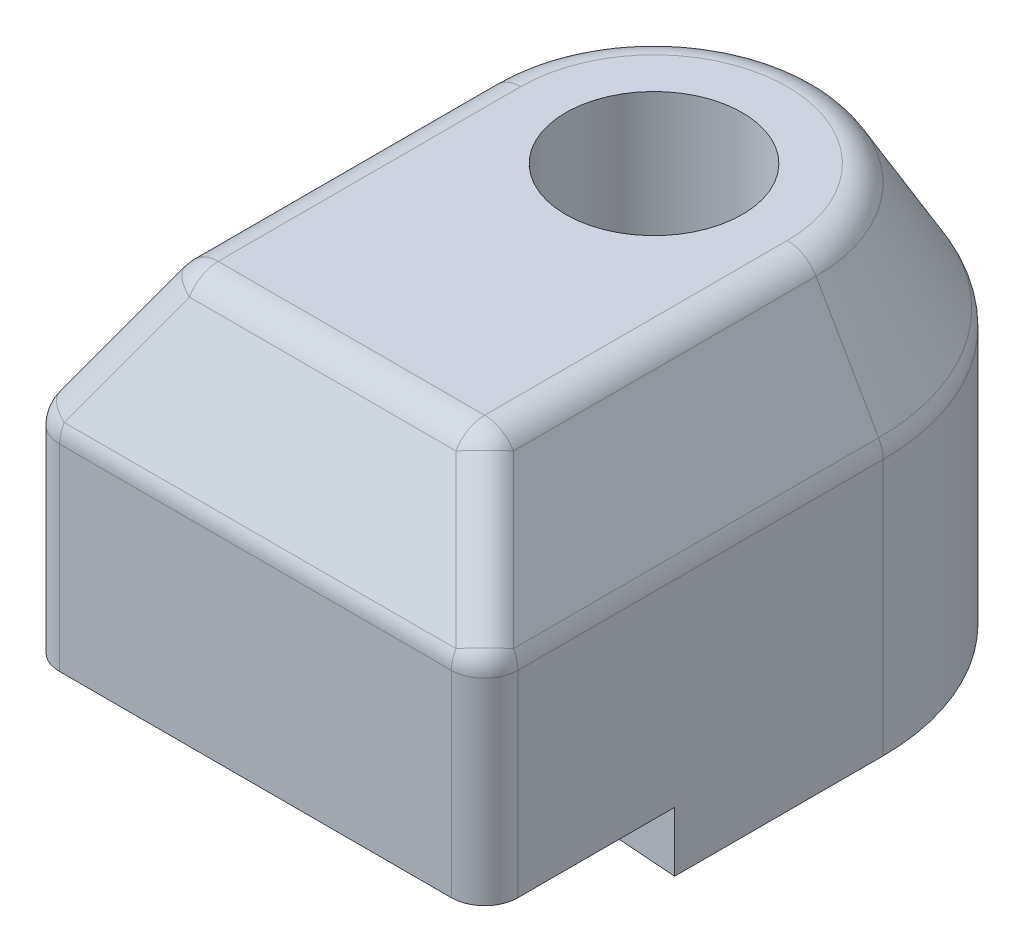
ISO-10303-21;
HEADER;
FILE_DESCRIPTION(('STEP AP214'),'2;1');
FILE_NAME('part.step','',(''),(''),'','','');
FILE_SCHEMA(('AUTOMOTIVE_DESIGN { 1 0 10303 214 1 1 1 1 }'));
ENDSEC;
DATA;
#1=APPLICATION_CONTEXT('core data for automotive mechanical design processes');
#2=APPLICATION_PROTOCOL_DEFINITION('international standard','automotive_design',2000,#1);
#3=PRODUCT_CONTEXT('',#1,'mechanical');
#4=PRODUCT('Part','Part','',(#3));
#5=PRODUCT_RELATED_PRODUCT_CATEGORY('part','',(#4));
#6=PRODUCT_DEFINITION_FORMATION('','',#4);
#7=PRODUCT_DEFINITION_CONTEXT('part definition',#1,'design');
#8=PRODUCT_DEFINITION('design','',#6,#7);
#9=PRODUCT_DEFINITION_SHAPE('','',#8);
#10=(LENGTH_UNIT() NAMED_UNIT(*) SI_UNIT(.MILLI.,.METRE.));
#11=(NAMED_UNIT(*) PLANE_ANGLE_UNIT() SI_UNIT($,.RADIAN.));
#12=(NAMED_UNIT(*) SI_UNIT($,.STERADIAN.) SOLID_ANGLE_UNIT());
#13=UNCERTAINTY_MEASURE_WITH_UNIT(LENGTH_MEASURE(1.E-05),#10,'distance_accuracy_value','');
#14=(GEOMETRIC_REPRESENTATION_CONTEXT(3) GLOBAL_UNCERTAINTY_ASSIGNED_CONTEXT((#13)) GLOBAL_UNIT_ASSIGNED_CONTEXT((#10,
#11,#12)) REPRESENTATION_CONTEXT('',''));
#15=CARTESIAN_POINT('',(0.,0.,0.));
#16=DIRECTION('',(0.,0.,1.));
#17=DIRECTION('',(1.,0.,0.));
#18=AXIS2_PLACEMENT_3D('',#15,#16,#17);
#19=CARTESIAN_POINT('',(-8.76299999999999,15.24,15.24));
#20=DIRECTION('',(0.,0.,-1.));
#21=DIRECTION('',(-1.,0.,0.));
#22=AXIS2_PLACEMENT_3D('',#19,#20,#21);
#23=PLANE('',#22);
#24=DIRECTION('',(-1.,0.,0.));
#25=VECTOR('',#24,1.);
#26=CARTESIAN_POINT('',(-8.76299999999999,2.286,15.24));
#27=LINE('',#26,#25);
#28=CARTESIAN_POINT('',(7.49299999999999,2.286,15.24));
#29=VERTEX_POINT('',#28);
#30=CARTESIAN_POINT('',(-7.49299999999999,2.286,15.24));
#31=VERTEX_POINT('',#30);
#32=EDGE_CURVE('E216',#29,#31,#27,.T.);
#33=ORIENTED_EDGE('',*,*,#32,.F.);
#34=DIRECTION('',(0.,-1.,0.));
#35=VECTOR('',#34,1.);
#36=CARTESIAN_POINT('',(7.49299999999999,15.24,15.24));
#37=LINE('',#36,#35);
#38=CARTESIAN_POINT('',(7.49299999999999,9.81970452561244,15.24));
#39=VERTEX_POINT('',#38);
#40=EDGE_CURVE('E63',#29,#39,#37,.F.);
#41=ORIENTED_EDGE('',*,*,#40,.T.);
#42=DIRECTION('',(-1.,0.,0.));
#43=VECTOR('',#42,1.);
#44=CARTESIAN_POINT('',(-8.76299999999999,9.81970452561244,15.24));
#45=LINE('',#44,#43);
#46=CARTESIAN_POINT('',(-7.49299999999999,9.81970452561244,15.24));
#47=VERTEX_POINT('',#46);
#48=EDGE_CURVE('E70',#39,#47,#45,.T.);
#49=ORIENTED_EDGE('',*,*,#48,.T.);
#50=DIRECTION('',(0.,-1.,0.));
#51=VECTOR('',#50,1.);
#52=CARTESIAN_POINT('',(-7.49299999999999,15.24,15.24));
#53=LINE('',#52,#51);
#54=EDGE_CURVE('E323',#47,#31,#53,.T.);
#55=ORIENTED_EDGE('',*,*,#54,.T.);
#56=EDGE_LOOP('',(#33,#41,#49,#55));
#57=FACE_BOUND('',#56,.T.);
#58=ADVANCED_FACE('F42',(#57),#23,.F.);
#59=CARTESIAN_POINT('',(0.,15.24,0.));
#60=DIRECTION('',(0.,-1.,0.));
#61=DIRECTION('',(0.,0.,-1.));
#62=AXIS2_PLACEMENT_3D('',#59,#60,#61);
#63=CYLINDRICAL_SURFACE('',#62,8.76299999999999);
#64=DIRECTION('',(0.,-1.,0.));
#65=VECTOR('',#64,1.);
#66=CARTESIAN_POINT('',(-8.76299999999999,15.24,0.));
#67=LINE('',#66,#65);
#68=CARTESIAN_POINT('',(-8.76299999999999,9.81970452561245,0.));
#69=VERTEX_POINT('',#68);
#70=CARTESIAN_POINT('',(-8.76299999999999,0.,0.));
#71=VERTEX_POINT('',#70);
#72=EDGE_CURVE('E247',#69,#71,#67,.T.);
#73=ORIENTED_EDGE('',*,*,#72,.F.);
#74=CARTESIAN_POINT('',(0.,9.81970452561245,0.));
#75=DIRECTION('',(0.,1.,0.));
#76=DIRECTION('',(0.,0.,1.));
#77=AXIS2_PLACEMENT_3D('',#74,#75,#76);
#78=CIRCLE('',#77,8.76299999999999);
#79=CARTESIAN_POINT('',(8.76299999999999,9.81970452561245,0.));
#80=VERTEX_POINT('',#79);
#81=EDGE_CURVE('E300',#69,#80,#78,.F.);
#82=ORIENTED_EDGE('',*,*,#81,.T.);
#83=DIRECTION('',(0.,-1.,0.));
#84=VECTOR('',#83,1.);
#85=CARTESIAN_POINT('',(8.76299999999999,15.24,0.));
#86=LINE('',#85,#84);
#87=CARTESIAN_POINT('',(8.76299999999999,0.,0.));
#88=VERTEX_POINT('',#87);
#89=EDGE_CURVE('E244',#80,#88,#86,.T.);
#90=ORIENTED_EDGE('',*,*,#89,.T.);
#91=CARTESIAN_POINT('',(0.,0.,0.));
#92=DIRECTION('',(0.,1.,0.));
#93=DIRECTION('',(0.,0.,1.));
#94=AXIS2_PLACEMENT_3D('',#91,#92,#93);
#95=CIRCLE('',#94,8.76299999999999);
#96=EDGE_CURVE('E234',#88,#71,#95,.T.);
#97=ORIENTED_EDGE('',*,*,#96,.T.);
#98=EDGE_LOOP('',(#73,#82,#90,#97));
#99=FACE_BOUND('',#98,.T.);
#100=ADVANCED_FACE('F469',(#99),#63,.T.);
#101=CARTESIAN_POINT('',(-8.76299999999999,15.24,0.));
#102=DIRECTION('',(1.,0.,0.));
#103=DIRECTION('',(0.,0.,-1.));
#104=AXIS2_PLACEMENT_3D('',#101,#102,#103);
#105=PLANE('',#104);
#106=DIRECTION('',(0.,-1.,0.));
#107=VECTOR('',#106,1.);
#108=CARTESIAN_POINT('',(-8.76299999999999,15.24,13.97));
#109=LINE('',#108,#107);
#110=CARTESIAN_POINT('',(-8.76299999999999,2.286,13.97));
#111=VERTEX_POINT('',#110);
#112=CARTESIAN_POINT('',(-8.76299999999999,9.81970452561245,13.97));
#113=VERTEX_POINT('',#112);
#114=EDGE_CURVE('E309',#111,#113,#109,.F.);
#115=ORIENTED_EDGE('',*,*,#114,.T.);
#116=DIRECTION('',(0.,0.,-1.));
#117=VECTOR('',#116,1.);
#118=CARTESIAN_POINT('',(-8.76299999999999,9.81970452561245,0.));
#119=LINE('',#118,#117);
#120=EDGE_CURVE('E312',#113,#69,#119,.T.);
#121=ORIENTED_EDGE('',*,*,#120,.T.);
#122=ORIENTED_EDGE('',*,*,#72,.T.);
#123=DIRECTION('',(0.,0.,1.));
#124=VECTOR('',#123,1.);
#125=CARTESIAN_POINT('',(-8.76299999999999,0.,0.));
#126=LINE('',#125,#124);
#127=CARTESIAN_POINT('',(-8.76299999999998,0.,7.97067474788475));
#128=VERTEX_POINT('',#127);
#129=EDGE_CURVE('E214',#71,#128,#126,.T.);
#130=ORIENTED_EDGE('',*,*,#129,.T.);
#131=DIRECTION('',(0.,-1.,0.));
#132=VECTOR('',#131,1.);
#133=CARTESIAN_POINT('',(-8.763,2.286,7.97067474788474));
#134=LINE('',#133,#132);
#135=CARTESIAN_POINT('',(-8.763,2.286,7.97067474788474));
#136=VERTEX_POINT('',#135);
#137=EDGE_CURVE('E204',#136,#128,#134,.T.);
#138=ORIENTED_EDGE('',*,*,#137,.F.);
#139=DIRECTION('',(0.,0.,-1.));
#140=VECTOR('',#139,1.);
#141=CARTESIAN_POINT('',(-8.76299999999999,2.286,15.24));
#142=LINE('',#141,#140);
#143=EDGE_CURVE('E188',#111,#136,#142,.T.);
#144=ORIENTED_EDGE('',*,*,#143,.F.);
#145=EDGE_LOOP('',(#115,#121,#122,#130,#138,#144));
#146=FACE_BOUND('',#145,.T.);
#147=ADVANCED_FACE('F212',(#146),#105,.F.);
#148=CARTESIAN_POINT('',(8.76299999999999,15.24,15.24));
#149=DIRECTION('',(-1.,0.,0.));
#150=DIRECTION('',(0.,0.,1.));
#151=AXIS2_PLACEMENT_3D('',#148,#149,#150);
#152=PLANE('',#151);
#153=ORIENTED_EDGE('',*,*,#89,.F.);
#154=DIRECTION('',(0.,0.,1.));
#155=VECTOR('',#154,1.);
#156=CARTESIAN_POINT('',(8.76299999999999,9.81970452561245,15.24));
#157=LINE('',#156,#155);
#158=CARTESIAN_POINT('',(8.76299999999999,9.81970452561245,13.97));
#159=VERTEX_POINT('',#158);
#160=EDGE_CURVE('E284',#80,#159,#157,.T.);
#161=ORIENTED_EDGE('',*,*,#160,.T.);
#162=DIRECTION('',(0.,-1.,0.));
#163=VECTOR('',#162,1.);
#164=CARTESIAN_POINT('',(8.76299999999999,15.24,13.97));
#165=LINE('',#164,#163);
#166=CARTESIAN_POINT('',(8.76299999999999,2.286,13.97));
#167=VERTEX_POINT('',#166);
#168=EDGE_CURVE('E281',#159,#167,#165,.T.);
#169=ORIENTED_EDGE('',*,*,#168,.T.);
#170=DIRECTION('',(0.,0.,1.));
#171=VECTOR('',#170,1.);
#172=CARTESIAN_POINT('',(8.76299999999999,2.286,15.24));
#173=LINE('',#172,#171);
#174=CARTESIAN_POINT('',(8.76299999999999,2.286,7.97067474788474));
#175=VERTEX_POINT('',#174);
#176=EDGE_CURVE('E209',#175,#167,#173,.T.);
#177=ORIENTED_EDGE('',*,*,#176,.F.);
#178=DIRECTION('',(0.,-1.,0.));
#179=VECTOR('',#178,1.);
#180=CARTESIAN_POINT('',(8.76299999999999,2.286,7.97067474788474));
#181=LINE('',#180,#179);
#182=CARTESIAN_POINT('',(8.76299999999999,0.,7.97067474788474));
#183=VERTEX_POINT('',#182);
#184=EDGE_CURVE('E207',#175,#183,#181,.T.);
#185=ORIENTED_EDGE('',*,*,#184,.T.);
#186=DIRECTION('',(0.,0.,-1.));
#187=VECTOR('',#186,1.);
#188=CARTESIAN_POINT('',(8.76299999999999,0.,15.24));
#189=LINE('',#188,#187);
#190=EDGE_CURVE('E240',#183,#88,#189,.T.);
#191=ORIENTED_EDGE('',*,*,#190,.T.);
#192=EDGE_LOOP('',(#153,#161,#169,#177,#185,#191));
#193=FACE_BOUND('',#192,.T.);
#194=ADVANCED_FACE('F464',(#193),#152,.F.);
#195=CARTESIAN_POINT('',(0.,15.24,0.));
#196=DIRECTION('',(0.,1.,0.));
#197=DIRECTION('',(0.,0.,1.));
#198=AXIS2_PLACEMENT_3D('',#195,#196,#197);
#199=PLANE('',#198);
#200=DIRECTION('',(1.,0.,0.));
#201=VECTOR('',#200,1.);
#202=CARTESIAN_POINT('',(0.,15.24,11.5738257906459));
#203=LINE('',#202,#201);
#204=CARTESIAN_POINT('',(-5.09682579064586,15.24,11.5738257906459));
#205=VERTEX_POINT('',#204);
#206=CARTESIAN_POINT('',(5.09682579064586,15.24,11.5738257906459));
#207=VERTEX_POINT('',#206);
#208=EDGE_CURVE('E250',#205,#207,#203,.T.);
#209=ORIENTED_EDGE('',*,*,#208,.T.);
#210=DIRECTION('',(0.,0.,-1.));
#211=VECTOR('',#210,1.);
#212=CARTESIAN_POINT('',(5.09682579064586,15.24,0.));
#213=LINE('',#212,#211);
#214=CARTESIAN_POINT('',(5.09682579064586,15.24,0.));
#215=VERTEX_POINT('',#214);
#216=EDGE_CURVE('E267',#207,#215,#213,.T.);
#217=ORIENTED_EDGE('',*,*,#216,.T.);
#218=CARTESIAN_POINT('',(0.,15.24,0.));
#219=DIRECTION('',(0.,1.,0.));
#220=DIRECTION('',(0.,0.,1.));
#221=AXIS2_PLACEMENT_3D('',#218,#219,#220);
#222=CIRCLE('',#221,5.09682579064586);
#223=CARTESIAN_POINT('',(-5.09682579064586,15.24,0.));
#224=VERTEX_POINT('',#223);
#225=EDGE_CURVE('E264',#215,#224,#222,.T.);
#226=ORIENTED_EDGE('',*,*,#225,.T.);
#227=DIRECTION('',(0.,0.,1.));
#228=VECTOR('',#227,1.);
#229=CARTESIAN_POINT('',(-5.09682579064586,15.24,0.));
#230=LINE('',#229,#228);
#231=EDGE_CURVE('E261',#224,#205,#230,.T.);
#232=ORIENTED_EDGE('',*,*,#231,.T.);
#233=EDGE_LOOP('',(#209,#217,#226,#232));
#234=FACE_BOUND('',#233,.T.);
#235=CARTESIAN_POINT('',(0.,15.24,0.));
#236=DIRECTION('',(0.,1.,0.));
#237=DIRECTION('',(0.,0.,1.));
#238=AXIS2_PLACEMENT_3D('',#235,#236,#237);
#239=CIRCLE('',#238,3.37819999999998);
#240=CARTESIAN_POINT('',(0.,15.24,3.37819999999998));
#241=VERTEX_POINT('',#240);
#242=EDGE_CURVE('E221',#241,#241,#239,.T.);
#243=ORIENTED_EDGE('',*,*,#242,.F.);
#244=EDGE_LOOP('',(#243));
#245=FACE_BOUND('',#244,.T.);
#246=ADVANCED_FACE('F488',(#234,#245),#199,.T.);
#247=CARTESIAN_POINT('',(0.,0.,0.));
#248=DIRECTION('',(0.,1.,0.));
#249=DIRECTION('',(0.,0.,1.));
#250=AXIS2_PLACEMENT_3D('',#247,#248,#249);
#251=PLANE('',#250);
#252=CARTESIAN_POINT('',(0.,0.,0.));
#253=DIRECTION('',(0.,1.,0.));
#254=DIRECTION('',(0.,0.,1.));
#255=AXIS2_PLACEMENT_3D('',#252,#253,#254);
#256=CIRCLE('',#255,3.37819999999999);
#257=CARTESIAN_POINT('',(0.,0.,3.37819999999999));
#258=VERTEX_POINT('',#257);
#259=EDGE_CURVE('E230',#258,#258,#256,.T.);
#260=ORIENTED_EDGE('',*,*,#259,.T.);
#261=EDGE_LOOP('',(#260));
#262=FACE_BOUND('',#261,.T.);
#263=ORIENTED_EDGE('',*,*,#190,.F.);
#264=CARTESIAN_POINT('',(0.,0.,117.2845));
#265=DIRECTION('',(0.,-1.,0.));
#266=DIRECTION('',(0.,0.,-1.));
#267=AXIS2_PLACEMENT_3D('',#264,#265,#266);
#268=CIRCLE('',#267,109.6645);
#269=EDGE_CURVE('E200',#128,#183,#268,.T.);
#270=ORIENTED_EDGE('',*,*,#269,.F.);
#271=ORIENTED_EDGE('',*,*,#129,.F.);
#272=ORIENTED_EDGE('',*,*,#96,.F.);
#273=EDGE_LOOP('',(#263,#270,#271,#272));
#274=FACE_BOUND('',#273,.T.);
#275=ADVANCED_FACE('F471',(#262,#274),#251,.F.);
#276=CARTESIAN_POINT('',(0.,15.24,0.));
#277=DIRECTION('',(0.,1.,0.));
#278=DIRECTION('',(0.,0.,1.));
#279=AXIS2_PLACEMENT_3D('',#276,#277,#278);
#280=CYLINDRICAL_SURFACE('',#279,3.37819999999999);
#281=ORIENTED_EDGE('',*,*,#259,.F.);
#282=EDGE_LOOP('',(#281));
#283=FACE_BOUND('',#282,.T.);
#284=ORIENTED_EDGE('',*,*,#242,.T.);
#285=EDGE_LOOP('',(#284));
#286=FACE_BOUND('',#285,.T.);
#287=ADVANCED_FACE('F494',(#283,#286),#280,.F.);
#288=CARTESIAN_POINT('',(0.,2.286,117.2845));
#289=DIRECTION('',(0.,-1.,0.));
#290=DIRECTION('',(0.,0.,-1.));
#291=AXIS2_PLACEMENT_3D('',#288,#289,#290);
#292=CYLINDRICAL_SURFACE('',#291,109.6645);
#293=ORIENTED_EDGE('',*,*,#269,.T.);
#294=ORIENTED_EDGE('',*,*,#184,.F.);
#295=CARTESIAN_POINT('',(0.,2.286,117.2845));
#296=DIRECTION('',(0.,-1.,0.));
#297=DIRECTION('',(0.,0.,-1.));
#298=AXIS2_PLACEMENT_3D('',#295,#296,#297);
#299=CIRCLE('',#298,109.6645);
#300=EDGE_CURVE('E192',#136,#175,#299,.T.);
#301=ORIENTED_EDGE('',*,*,#300,.F.);
#302=ORIENTED_EDGE('',*,*,#137,.T.);
#303=EDGE_LOOP('',(#293,#294,#301,#302));
#304=FACE_BOUND('',#303,.T.);
#305=ADVANCED_FACE('F203',(#304),#292,.F.);
#306=CARTESIAN_POINT('',(0.,2.286,117.2845));
#307=DIRECTION('',(0.,-1.,0.));
#308=DIRECTION('',(0.,0.,-1.));
#309=AXIS2_PLACEMENT_3D('',#306,#307,#308);
#310=PLANE('',#309);
#311=ORIENTED_EDGE('',*,*,#176,.T.);
#312=CARTESIAN_POINT('',(7.49299999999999,2.286,13.97));
#313=DIRECTION('',(0.,-1.,0.));
#314=DIRECTION('',(0.,0.,-1.));
#315=AXIS2_PLACEMENT_3D('',#312,#313,#314);
#316=CIRCLE('',#315,1.27);
#317=EDGE_CURVE('E11',#167,#29,#316,.T.);
#318=ORIENTED_EDGE('',*,*,#317,.T.);
#319=ORIENTED_EDGE('',*,*,#32,.T.);
#320=CARTESIAN_POINT('',(-7.49299999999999,2.286,13.97));
#321=DIRECTION('',(0.,-1.,0.));
#322=DIRECTION('',(0.,0.,-1.));
#323=AXIS2_PLACEMENT_3D('',#320,#321,#322);
#324=CIRCLE('',#323,1.27);
#325=EDGE_CURVE('E52',#31,#111,#324,.T.);
#326=ORIENTED_EDGE('',*,*,#325,.T.);
#327=ORIENTED_EDGE('',*,*,#143,.T.);
#328=ORIENTED_EDGE('',*,*,#300,.T.);
#329=EDGE_LOOP('',(#311,#318,#319,#326,#327,#328));
#330=FACE_BOUND('',#329,.T.);
#331=ADVANCED_FACE('F191',(#330),#310,.T.);
#332=CARTESIAN_POINT('',(0.,15.24,12.3070606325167));
#333=DIRECTION('',(0.,0.499999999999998,0.86602540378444));
#334=DIRECTION('',(-1.,0.,0.));
#335=AXIS2_PLACEMENT_3D('',#332,#333,#334);
#336=PLANE('',#335);
#337=DIRECTION('',(-0.447213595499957,-0.774596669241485,0.447213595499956));
#338=VECTOR('',#337,1.);
#339=CARTESIAN_POINT('',(-3.78416669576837,16.8785922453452,11.3610189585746));
#340=LINE('',#339,#338);
#341=CARTESIAN_POINT('',(-5.09682579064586,14.605,12.6736780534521));
#342=VERTEX_POINT('',#341);
#343=CARTESIAN_POINT('',(-7.49299999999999,10.4547045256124,15.0698522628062));
#344=VERTEX_POINT('',#343);
#345=EDGE_CURVE('E291',#342,#344,#340,.T.);
#346=ORIENTED_EDGE('',*,*,#345,.T.);
#347=DIRECTION('',(-1.,0.,0.));
#348=VECTOR('',#347,1.);
#349=CARTESIAN_POINT('',(8.76299999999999,10.4547045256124,15.0698522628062));
#350=LINE('',#349,#348);
#351=CARTESIAN_POINT('',(7.49299999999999,10.4547045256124,15.0698522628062));
#352=VERTEX_POINT('',#351);
#353=EDGE_CURVE('E297',#344,#352,#350,.F.);
#354=ORIENTED_EDGE('',*,*,#353,.T.);
#355=DIRECTION('',(-0.447213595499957,0.774596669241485,-0.447213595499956));
#356=VECTOR('',#355,1.);
#357=CARTESIAN_POINT('',(3.78416669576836,16.8785922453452,11.3610189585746));
#358=LINE('',#357,#356);
#359=CARTESIAN_POINT('',(5.09682579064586,14.605,12.6736780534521));
#360=VERTEX_POINT('',#359);
#361=EDGE_CURVE('E293',#352,#360,#358,.T.);
#362=ORIENTED_EDGE('',*,*,#361,.T.);
#363=DIRECTION('',(1.,0.,0.));
#364=VECTOR('',#363,1.);
#365=CARTESIAN_POINT('',(0.,14.605,12.6736780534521));
#366=LINE('',#365,#364);
#367=EDGE_CURVE('E288',#360,#342,#366,.F.);
#368=ORIENTED_EDGE('',*,*,#367,.T.);
#369=EDGE_LOOP('',(#346,#354,#362,#368));
#370=FACE_BOUND('',#369,.T.);
#371=ADVANCED_FACE('F453',(#370),#336,.T.);
#372=CARTESIAN_POINT('',(-5.83006063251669,15.24,0.));
#373=DIRECTION('',(-0.86602540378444,0.499999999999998,0.));
#374=DIRECTION('',(0.,0.,-1.));
#375=AXIS2_PLACEMENT_3D('',#372,#373,#374);
#376=PLANE('',#375);
#377=DIRECTION('',(0.499999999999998,0.86602540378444,0.));
#378=VECTOR('',#377,1.);
#379=CARTESIAN_POINT('',(-8.76299999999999,10.16,0.));
#380=LINE('',#379,#378);
#381=CARTESIAN_POINT('',(-8.59285226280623,10.4547045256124,0.));
#382=VERTEX_POINT('',#381);
#383=CARTESIAN_POINT('',(-6.1966780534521,14.605,0.));
#384=VERTEX_POINT('',#383);
#385=EDGE_CURVE('E255',#382,#384,#380,.T.);
#386=ORIENTED_EDGE('',*,*,#385,.F.);
#387=DIRECTION('',(0.,0.,-1.));
#388=VECTOR('',#387,1.);
#389=CARTESIAN_POINT('',(-8.59285226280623,10.4547045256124,15.24));
#390=LINE('',#389,#388);
#391=CARTESIAN_POINT('',(-8.59285226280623,10.4547045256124,13.97));
#392=VERTEX_POINT('',#391);
#393=EDGE_CURVE('E320',#382,#392,#390,.F.);
#394=ORIENTED_EDGE('',*,*,#393,.T.);
#395=DIRECTION('',(-0.447213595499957,-0.774596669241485,0.447213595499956));
#396=VECTOR('',#395,1.);
#397=CARTESIAN_POINT('',(-3.58861895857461,19.1222908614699,8.96576669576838));
#398=LINE('',#397,#396);
#399=CARTESIAN_POINT('',(-6.1966780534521,14.605,11.5738257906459));
#400=VERTEX_POINT('',#399);
#401=EDGE_CURVE('E315',#392,#400,#398,.F.);
#402=ORIENTED_EDGE('',*,*,#401,.T.);
#403=DIRECTION('',(0.,0.,1.));
#404=VECTOR('',#403,1.);
#405=CARTESIAN_POINT('',(-6.1966780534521,14.605,0.));
#406=LINE('',#405,#404);
#407=EDGE_CURVE('E318',#400,#384,#406,.F.);
#408=ORIENTED_EDGE('',*,*,#407,.T.);
#409=EDGE_LOOP('',(#386,#394,#402,#408));
#410=FACE_BOUND('',#409,.T.);
#411=ADVANCED_FACE('F413',(#410),#376,.T.);
#412=CARTESIAN_POINT('',(0.,15.24,0.));
#413=DIRECTION('',(0.,-1.,0.));
#414=DIRECTION('',(0.,0.,-1.));
#415=AXIS2_PLACEMENT_3D('',#412,#413,#414);
#416=CONICAL_SURFACE('',#415,5.83006063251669,0.523598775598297);
#417=DIRECTION('',(-0.499999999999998,0.86602540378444,0.));
#418=VECTOR('',#417,1.);
#419=CARTESIAN_POINT('',(8.76299999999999,10.16,0.));
#420=LINE('',#419,#418);
#421=CARTESIAN_POINT('',(8.59285226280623,10.4547045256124,0.));
#422=VERTEX_POINT('',#421);
#423=CARTESIAN_POINT('',(6.1966780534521,14.605,0.));
#424=VERTEX_POINT('',#423);
#425=EDGE_CURVE('E251',#422,#424,#420,.T.);
#426=ORIENTED_EDGE('',*,*,#425,.F.);
#427=CARTESIAN_POINT('',(0.,10.4547045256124,0.));
#428=DIRECTION('',(0.,-1.,0.));
#429=DIRECTION('',(0.,0.,-1.));
#430=AXIS2_PLACEMENT_3D('',#427,#428,#429);
#431=CIRCLE('',#430,8.59285226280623);
#432=EDGE_CURVE('E306',#422,#382,#431,.F.);
#433=ORIENTED_EDGE('',*,*,#432,.T.);
#434=ORIENTED_EDGE('',*,*,#385,.T.);
#435=CARTESIAN_POINT('',(0.,14.605,0.));
#436=DIRECTION('',(0.,1.,0.));
#437=DIRECTION('',(0.,0.,1.));
#438=AXIS2_PLACEMENT_3D('',#435,#436,#437);
#439=CIRCLE('',#438,6.1966780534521);
#440=EDGE_CURVE('E303',#384,#424,#439,.F.);
#441=ORIENTED_EDGE('',*,*,#440,.T.);
#442=EDGE_LOOP('',(#426,#433,#434,#441));
#443=FACE_BOUND('',#442,.T.);
#444=ADVANCED_FACE('F420',(#443),#416,.T.);
#445=CARTESIAN_POINT('',(5.83006063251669,15.24,0.));
#446=DIRECTION('',(0.86602540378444,0.499999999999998,0.));
#447=DIRECTION('',(0.,0.,1.));
#448=AXIS2_PLACEMENT_3D('',#445,#446,#447);
#449=PLANE('',#448);
#450=ORIENTED_EDGE('',*,*,#425,.T.);
#451=DIRECTION('',(0.,0.,-1.));
#452=VECTOR('',#451,1.);
#453=CARTESIAN_POINT('',(6.1966780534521,14.605,0.));
#454=LINE('',#453,#452);
#455=CARTESIAN_POINT('',(6.1966780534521,14.605,11.5738257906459));
#456=VERTEX_POINT('',#455);
#457=EDGE_CURVE('E277',#424,#456,#454,.F.);
#458=ORIENTED_EDGE('',*,*,#457,.T.);
#459=DIRECTION('',(-0.447213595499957,0.774596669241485,-0.447213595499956));
#460=VECTOR('',#459,1.);
#461=CARTESIAN_POINT('',(3.58861895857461,19.1222908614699,8.96576669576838));
#462=LINE('',#461,#460);
#463=CARTESIAN_POINT('',(8.59285226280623,10.4547045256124,13.97));
#464=VERTEX_POINT('',#463);
#465=EDGE_CURVE('E271',#456,#464,#462,.F.);
#466=ORIENTED_EDGE('',*,*,#465,.T.);
#467=DIRECTION('',(0.,0.,1.));
#468=VECTOR('',#467,1.);
#469=CARTESIAN_POINT('',(8.59285226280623,10.4547045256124,0.));
#470=LINE('',#469,#468);
#471=EDGE_CURVE('E274',#464,#422,#470,.F.);
#472=ORIENTED_EDGE('',*,*,#471,.T.);
#473=EDGE_LOOP('',(#450,#458,#466,#472));
#474=FACE_BOUND('',#473,.T.);
#475=ADVANCED_FACE('F435',(#474),#449,.T.);
#476=CARTESIAN_POINT('',(-7.49299999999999,15.24,13.97));
#477=DIRECTION('',(0.,-1.,0.));
#478=DIRECTION('',(0.,0.,-1.));
#479=AXIS2_PLACEMENT_3D('',#476,#477,#478);
#480=CYLINDRICAL_SURFACE('',#479,1.27);
#481=ORIENTED_EDGE('',*,*,#325,.F.);
#482=ORIENTED_EDGE('',*,*,#54,.F.);
#483=CARTESIAN_POINT('',(-7.49299999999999,9.81970452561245,13.97));
#484=DIRECTION('',(0.,1.,0.));
#485=DIRECTION('',(0.,0.,1.));
#486=AXIS2_PLACEMENT_3D('',#483,#484,#485);
#487=CIRCLE('',#486,1.27);
#488=EDGE_CURVE('E391',#113,#47,#487,.T.);
#489=ORIENTED_EDGE('',*,*,#488,.F.);
#490=ORIENTED_EDGE('',*,*,#114,.F.);
#491=EDGE_LOOP('',(#481,#482,#489,#490));
#492=FACE_BOUND('',#491,.T.);
#493=ADVANCED_FACE('F44',(#492),#480,.T.);
#494=CARTESIAN_POINT('',(-7.49299999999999,9.81970452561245,0.));
#495=DIRECTION('',(0.,0.,1.));
#496=DIRECTION('',(1.,0.,0.));
#497=AXIS2_PLACEMENT_3D('',#494,#495,#496);
#498=CYLINDRICAL_SURFACE('',#497,1.27);
#499=CARTESIAN_POINT('',(-7.49299999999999,9.81970452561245,13.97));
#500=DIRECTION('',(0.,0.,1.));
#501=DIRECTION('',(0.,-1.,0.));
#502=AXIS2_PLACEMENT_3D('',#499,#500,#501);
#503=CIRCLE('',#502,1.27);
#504=EDGE_CURVE('E388',#392,#113,#503,.T.);
#505=ORIENTED_EDGE('',*,*,#504,.F.);
#506=ORIENTED_EDGE('',*,*,#393,.F.);
#507=CARTESIAN_POINT('',(-7.49299999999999,9.81970452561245,0.));
#508=DIRECTION('',(0.,0.,-1.));
#509=DIRECTION('',(-1.,0.,0.));
#510=AXIS2_PLACEMENT_3D('',#507,#508,#509);
#511=CIRCLE('',#510,1.27);
#512=EDGE_CURVE('E46',#69,#382,#511,.T.);
#513=ORIENTED_EDGE('',*,*,#512,.F.);
#514=ORIENTED_EDGE('',*,*,#120,.F.);
#515=EDGE_LOOP('',(#505,#506,#513,#514));
#516=FACE_BOUND('',#515,.T.);
#517=ADVANCED_FACE('F409',(#516),#498,.T.);
#518=CARTESIAN_POINT('',(0.,9.81970452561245,0.));
#519=DIRECTION('',(0.,1.,0.));
#520=DIRECTION('',(0.,0.,1.));
#521=AXIS2_PLACEMENT_3D('',#518,#519,#520);
#522=TOROIDAL_SURFACE('',#521,7.49299999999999,1.27);
#523=ORIENTED_EDGE('',*,*,#512,.T.);
#524=ORIENTED_EDGE('',*,*,#432,.F.);
#525=CARTESIAN_POINT('',(7.49299999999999,9.81970452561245,0.));
#526=DIRECTION('',(0.,0.,1.));
#527=DIRECTION('',(0.,-1.,0.));
#528=AXIS2_PLACEMENT_3D('',#525,#526,#527);
#529=CIRCLE('',#528,1.27);
#530=EDGE_CURVE('E384',#80,#422,#529,.T.);
#531=ORIENTED_EDGE('',*,*,#530,.F.);
#532=ORIENTED_EDGE('',*,*,#81,.F.);
#533=EDGE_LOOP('',(#523,#524,#531,#532));
#534=FACE_BOUND('',#533,.T.);
#535=ADVANCED_FACE('F403',(#534),#522,.T.);
#536=CARTESIAN_POINT('',(-7.49299999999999,9.81970452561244,13.97));
#537=DIRECTION('',(0.,0.,1.));
#538=DIRECTION('',(1.,0.,0.));
#539=AXIS2_PLACEMENT_3D('',#536,#537,#538);
#540=SPHERICAL_SURFACE('',#539,1.27);
#541=ORIENTED_EDGE('',*,*,#504,.T.);
#542=ORIENTED_EDGE('',*,*,#488,.T.);
#543=CARTESIAN_POINT('',(-7.49299999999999,9.81970452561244,13.97));
#544=DIRECTION('',(-1.,0.,0.));
#545=DIRECTION('',(0.,-1.,0.));
#546=AXIS2_PLACEMENT_3D('',#543,#544,#545);
#547=CIRCLE('',#546,1.27);
#548=EDGE_CURVE('E380',#344,#47,#547,.F.);
#549=ORIENTED_EDGE('',*,*,#548,.F.);
#550=CARTESIAN_POINT('',(-7.49299999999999,9.81970452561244,13.97));
#551=DIRECTION('',(-0.447213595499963,-0.774596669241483,0.447213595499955));
#552=DIRECTION('',(0.866025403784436,-0.500000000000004,0.));
#553=AXIS2_PLACEMENT_3D('',#550,#551,#552);
#554=CIRCLE('',#553,1.27);
#555=EDGE_CURVE('E376',#392,#344,#554,.F.);
#556=ORIENTED_EDGE('',*,*,#555,.F.);
#557=EDGE_LOOP('',(#541,#542,#549,#556));
#558=FACE_BOUND('',#557,.T.);
#559=ADVANCED_FACE('F476',(#558),#540,.T.);
#560=CARTESIAN_POINT('',(7.49299999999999,9.81970452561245,15.24));
#561=DIRECTION('',(0.,0.,-1.));
#562=DIRECTION('',(-1.,0.,0.));
#563=AXIS2_PLACEMENT_3D('',#560,#561,#562);
#564=CYLINDRICAL_SURFACE('',#563,1.27);
#565=ORIENTED_EDGE('',*,*,#530,.T.);
#566=ORIENTED_EDGE('',*,*,#471,.F.);
#567=CARTESIAN_POINT('',(7.49299999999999,9.81970452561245,13.97));
#568=DIRECTION('',(0.,0.,1.));
#569=DIRECTION('',(0.,-1.,0.));
#570=AXIS2_PLACEMENT_3D('',#567,#568,#569);
#571=CIRCLE('',#570,1.27);
#572=EDGE_CURVE('E372',#159,#464,#571,.T.);
#573=ORIENTED_EDGE('',*,*,#572,.F.);
#574=ORIENTED_EDGE('',*,*,#160,.F.);
#575=EDGE_LOOP('',(#565,#566,#573,#574));
#576=FACE_BOUND('',#575,.T.);
#577=ADVANCED_FACE('F440',(#576),#564,.T.);
#578=CARTESIAN_POINT('',(7.49299999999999,15.24,13.97));
#579=DIRECTION('',(0.,-1.,0.));
#580=DIRECTION('',(0.,0.,-1.));
#581=AXIS2_PLACEMENT_3D('',#578,#579,#580);
#582=CYLINDRICAL_SURFACE('',#581,1.27);
#583=ORIENTED_EDGE('',*,*,#317,.F.);
#584=ORIENTED_EDGE('',*,*,#168,.F.);
#585=CARTESIAN_POINT('',(7.49299999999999,9.81970452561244,13.97));
#586=DIRECTION('',(0.,1.,0.));
#587=DIRECTION('',(-1.,0.,0.));
#588=AXIS2_PLACEMENT_3D('',#585,#586,#587);
#589=CIRCLE('',#588,1.27);
#590=EDGE_CURVE('E369',#39,#159,#589,.T.);
#591=ORIENTED_EDGE('',*,*,#590,.F.);
#592=ORIENTED_EDGE('',*,*,#40,.F.);
#593=EDGE_LOOP('',(#583,#584,#591,#592));
#594=FACE_BOUND('',#593,.T.);
#595=ADVANCED_FACE('F461',(#594),#582,.T.);
#596=CARTESIAN_POINT('',(-8.76299999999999,9.81970452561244,13.97));
#597=DIRECTION('',(1.,0.,0.));
#598=DIRECTION('',(0.,0.,-1.));
#599=AXIS2_PLACEMENT_3D('',#596,#597,#598);
#600=CYLINDRICAL_SURFACE('',#599,1.27);
#601=ORIENTED_EDGE('',*,*,#548,.T.);
#602=ORIENTED_EDGE('',*,*,#48,.F.);
#603=CARTESIAN_POINT('',(7.49299999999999,9.81970452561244,13.97));
#604=DIRECTION('',(1.,0.,0.));
#605=DIRECTION('',(0.,1.,0.));
#606=AXIS2_PLACEMENT_3D('',#603,#604,#605);
#607=CIRCLE('',#606,1.27);
#608=EDGE_CURVE('E365',#352,#39,#607,.T.);
#609=ORIENTED_EDGE('',*,*,#608,.F.);
#610=ORIENTED_EDGE('',*,*,#353,.F.);
#611=EDGE_LOOP('',(#601,#602,#609,#610));
#612=FACE_BOUND('',#611,.T.);
#613=ADVANCED_FACE('F458',(#612),#600,.T.);
#614=CARTESIAN_POINT('',(-3.78416669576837,16.2435922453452,10.2611666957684));
#615=DIRECTION('',(-0.447213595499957,-0.774596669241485,0.447213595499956));
#616=DIRECTION('',(0.86602540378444,-0.499999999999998,0.));
#617=AXIS2_PLACEMENT_3D('',#614,#615,#616);
#618=CYLINDRICAL_SURFACE('',#617,1.27);
#619=ORIENTED_EDGE('',*,*,#555,.T.);
#620=ORIENTED_EDGE('',*,*,#345,.F.);
#621=CARTESIAN_POINT('',(-5.09682579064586,13.97,11.5738257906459));
#622=DIRECTION('',(0.447213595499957,0.774596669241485,-0.447213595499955));
#623=DIRECTION('',(-0.866025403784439,0.499999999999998,0.));
#624=AXIS2_PLACEMENT_3D('',#621,#622,#623);
#625=CIRCLE('',#624,1.27);
#626=EDGE_CURVE('E361',#400,#342,#625,.T.);
#627=ORIENTED_EDGE('',*,*,#626,.F.);
#628=ORIENTED_EDGE('',*,*,#401,.F.);
#629=EDGE_LOOP('',(#619,#620,#627,#628));
#630=FACE_BOUND('',#629,.T.);
#631=ADVANCED_FACE('F478',(#630),#618,.T.);
#632=CARTESIAN_POINT('',(7.49299999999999,9.81970452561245,13.97));
#633=DIRECTION('',(0.,0.,1.));
#634=DIRECTION('',(1.,0.,0.));
#635=AXIS2_PLACEMENT_3D('',#632,#633,#634);
#636=SPHERICAL_SURFACE('',#635,1.27);
#637=ORIENTED_EDGE('',*,*,#590,.T.);
#638=ORIENTED_EDGE('',*,*,#572,.T.);
#639=CARTESIAN_POINT('',(7.49299999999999,9.81970452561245,13.97));
#640=DIRECTION('',(0.447213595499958,-0.774596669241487,0.447213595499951));
#641=DIRECTION('',(0.86602540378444,0.499999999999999,0.));
#642=AXIS2_PLACEMENT_3D('',#639,#640,#641);
#643=CIRCLE('',#642,1.27);
#644=EDGE_CURVE('E357',#352,#464,#643,.F.);
#645=ORIENTED_EDGE('',*,*,#644,.F.);
#646=ORIENTED_EDGE('',*,*,#608,.T.);
#647=EDGE_LOOP('',(#637,#638,#645,#646));
#648=FACE_BOUND('',#647,.T.);
#649=ADVANCED_FACE('F445',(#648),#636,.T.);
#650=CARTESIAN_POINT('',(-5.09682579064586,13.97,11.5738257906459));
#651=DIRECTION('',(0.,0.,1.));
#652=DIRECTION('',(1.,0.,0.));
#653=AXIS2_PLACEMENT_3D('',#650,#651,#652);
#654=SPHERICAL_SURFACE('',#653,1.27);
#655=CARTESIAN_POINT('',(-5.09682579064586,13.97,11.5738257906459));
#656=DIRECTION('',(0.,0.,1.));
#657=DIRECTION('',(1.,0.,0.));
#658=AXIS2_PLACEMENT_3D('',#655,#656,#657);
#659=CIRCLE('',#658,1.27);
#660=EDGE_CURVE('E349',#400,#205,#659,.F.);
#661=ORIENTED_EDGE('',*,*,#660,.F.);
#662=ORIENTED_EDGE('',*,*,#626,.T.);
#663=CARTESIAN_POINT('',(-5.09682579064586,13.97,11.5738257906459));
#664=DIRECTION('',(-1.,0.,0.));
#665=DIRECTION('',(0.,-1.,0.));
#666=AXIS2_PLACEMENT_3D('',#663,#664,#665);
#667=CIRCLE('',#666,1.27);
#668=EDGE_CURVE('E353',#205,#342,#667,.F.);
#669=ORIENTED_EDGE('',*,*,#668,.F.);
#670=EDGE_LOOP('',(#661,#662,#669));
#671=FACE_BOUND('',#670,.T.);
#672=ADVANCED_FACE('F482',(#671),#654,.T.);
#673=CARTESIAN_POINT('',(3.78416669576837,16.2435922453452,10.2611666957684));
#674=DIRECTION('',(-0.447213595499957,0.774596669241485,-0.447213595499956));
#675=DIRECTION('',(-0.86602540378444,-0.499999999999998,0.));
#676=AXIS2_PLACEMENT_3D('',#673,#674,#675);
#677=CYLINDRICAL_SURFACE('',#676,1.27);
#678=ORIENTED_EDGE('',*,*,#644,.T.);
#679=ORIENTED_EDGE('',*,*,#465,.F.);
#680=CARTESIAN_POINT('',(5.09682579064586,13.97,11.5738257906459));
#681=DIRECTION('',(-0.447213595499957,0.774596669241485,-0.447213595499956));
#682=DIRECTION('',(-0.866025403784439,-0.499999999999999,0.));
#683=AXIS2_PLACEMENT_3D('',#680,#681,#682);
#684=CIRCLE('',#683,1.27);
#685=EDGE_CURVE('E345',#360,#456,#684,.T.);
#686=ORIENTED_EDGE('',*,*,#685,.F.);
#687=ORIENTED_EDGE('',*,*,#361,.F.);
#688=EDGE_LOOP('',(#678,#679,#686,#687));
#689=FACE_BOUND('',#688,.T.);
#690=ADVANCED_FACE('F449',(#689),#677,.T.);
#691=CARTESIAN_POINT('',(0.,13.97,11.5738257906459));
#692=DIRECTION('',(1.,0.,0.));
#693=DIRECTION('',(0.,0.,-1.));
#694=AXIS2_PLACEMENT_3D('',#691,#692,#693);
#695=CYLINDRICAL_SURFACE('',#694,1.27);
#696=ORIENTED_EDGE('',*,*,#668,.T.);
#697=ORIENTED_EDGE('',*,*,#367,.F.);
#698=CARTESIAN_POINT('',(5.09682579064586,13.97,11.5738257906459));
#699=DIRECTION('',(1.,0.,0.));
#700=DIRECTION('',(0.,0.,-1.));
#701=AXIS2_PLACEMENT_3D('',#698,#699,#700);
#702=CIRCLE('',#701,1.27);
#703=EDGE_CURVE('E342',#207,#360,#702,.T.);
#704=ORIENTED_EDGE('',*,*,#703,.F.);
#705=ORIENTED_EDGE('',*,*,#208,.F.);
#706=EDGE_LOOP('',(#696,#697,#704,#705));
#707=FACE_BOUND('',#706,.T.);
#708=ADVANCED_FACE('F486',(#707),#695,.T.);
#709=CARTESIAN_POINT('',(-5.09682579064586,13.97,0.));
#710=DIRECTION('',(0.,0.,1.));
#711=DIRECTION('',(1.,0.,0.));
#712=AXIS2_PLACEMENT_3D('',#709,#710,#711);
#713=CYLINDRICAL_SURFACE('',#712,1.27);
#714=ORIENTED_EDGE('',*,*,#660,.T.);
#715=ORIENTED_EDGE('',*,*,#231,.F.);
#716=CARTESIAN_POINT('',(-5.09682579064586,13.97,0.));
#717=DIRECTION('',(0.,0.,-1.));
#718=DIRECTION('',(0.,1.,0.));
#719=AXIS2_PLACEMENT_3D('',#716,#717,#718);
#720=CIRCLE('',#719,1.27);
#721=EDGE_CURVE('E338',#384,#224,#720,.T.);
#722=ORIENTED_EDGE('',*,*,#721,.F.);
#723=ORIENTED_EDGE('',*,*,#407,.F.);
#724=EDGE_LOOP('',(#714,#715,#722,#723));
#725=FACE_BOUND('',#724,.T.);
#726=ADVANCED_FACE('F424',(#725),#713,.T.);
#727=CARTESIAN_POINT('',(5.09682579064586,13.97,11.5738257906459));
#728=DIRECTION('',(0.,0.,1.));
#729=DIRECTION('',(1.,0.,0.));
#730=AXIS2_PLACEMENT_3D('',#727,#728,#729);
#731=SPHERICAL_SURFACE('',#730,1.27);
#732=ORIENTED_EDGE('',*,*,#703,.T.);
#733=ORIENTED_EDGE('',*,*,#685,.T.);
#734=CARTESIAN_POINT('',(5.09682579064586,13.97,11.5738257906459));
#735=DIRECTION('',(0.,0.,1.));
#736=DIRECTION('',(1.,0.,0.));
#737=AXIS2_PLACEMENT_3D('',#734,#735,#736);
#738=CIRCLE('',#737,1.27);
#739=EDGE_CURVE('E335',#207,#456,#738,.F.);
#740=ORIENTED_EDGE('',*,*,#739,.F.);
#741=EDGE_LOOP('',(#732,#733,#740));
#742=FACE_BOUND('',#741,.T.);
#743=ADVANCED_FACE('F528',(#742),#731,.T.);
#744=CARTESIAN_POINT('',(0.,13.97,0.));
#745=DIRECTION('',(0.,1.,0.));
#746=DIRECTION('',(0.,0.,1.));
#747=AXIS2_PLACEMENT_3D('',#744,#745,#746);
#748=TOROIDAL_SURFACE('',#747,5.09682579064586,1.27);
#749=ORIENTED_EDGE('',*,*,#721,.T.);
#750=ORIENTED_EDGE('',*,*,#225,.F.);
#751=CARTESIAN_POINT('',(5.09682579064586,13.97,0.));
#752=DIRECTION('',(0.,0.,1.));
#753=DIRECTION('',(0.,-1.,0.));
#754=AXIS2_PLACEMENT_3D('',#751,#752,#753);
#755=CIRCLE('',#754,1.27);
#756=EDGE_CURVE('E332',#424,#215,#755,.T.);
#757=ORIENTED_EDGE('',*,*,#756,.F.);
#758=ORIENTED_EDGE('',*,*,#440,.F.);
#759=EDGE_LOOP('',(#749,#750,#757,#758));
#760=FACE_BOUND('',#759,.T.);
#761=ADVANCED_FACE('F428',(#760),#748,.T.);
#762=CARTESIAN_POINT('',(5.09682579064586,13.97,0.));
#763=DIRECTION('',(0.,0.,-1.));
#764=DIRECTION('',(-1.,0.,0.));
#765=AXIS2_PLACEMENT_3D('',#762,#763,#764);
#766=CYLINDRICAL_SURFACE('',#765,1.27);
#767=ORIENTED_EDGE('',*,*,#739,.T.);
#768=ORIENTED_EDGE('',*,*,#457,.F.);
#769=ORIENTED_EDGE('',*,*,#756,.T.);
#770=ORIENTED_EDGE('',*,*,#216,.F.);
#771=EDGE_LOOP('',(#767,#768,#769,#770));
#772=FACE_BOUND('',#771,.T.);
#773=ADVANCED_FACE('F432',(#772),#766,.T.);
#774=CLOSED_SHELL('',(#58,#100,#147,#194,#246,#275,#287,#305,#331,#371,#411,#444,#475,#493,#517,
#535,#559,#577,#595,#613,#631,#649,#672,#690,#708,#726,#743,#761,#773));
#775=MANIFOLD_SOLID_BREP('B2',#774);
#776=ADVANCED_BREP_SHAPE_REPRESENTATION('',(#18,#775),#14);
#777=SHAPE_DEFINITION_REPRESENTATION(#9,#776);
ENDSEC;
END-ISO-10303-21;
